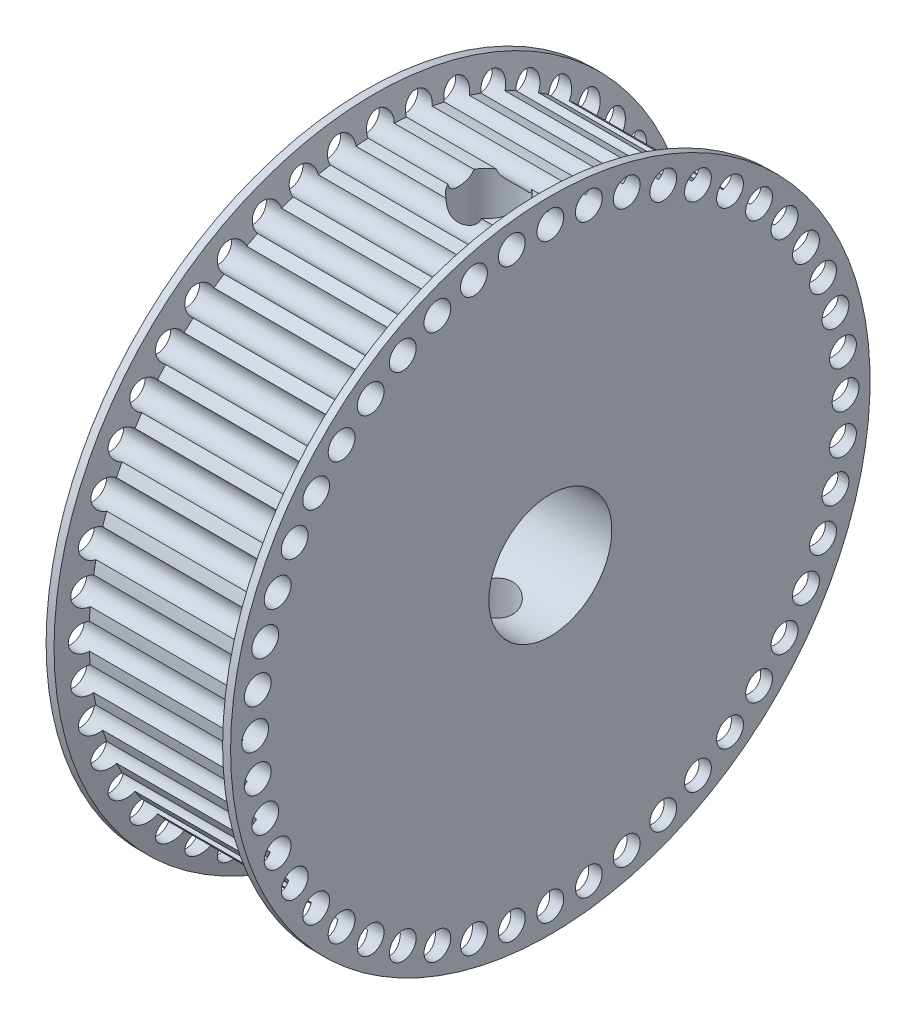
from build123d import *

# Parameters (mm, degrees)
SKETCH3_R          = 2.7686
CUT_EXTRUDE2_DEPTH = 101.86710663
CIRPATTERN1_COUNT  = 48
SKETCH5_R          = 3.175
CUT_EXTRUDE3_DEPTH = 147.645135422
SKETCH6_R          = 4.8895
CUT_EXTRUDE4_DEPTH = 120.65
SKETCH7_R          = 6.35
CUT_EXTRUDE5_DEPTH = 19.05


with BuildPart() as part:
    # Sketch1 → Revolve2 (revolve)
    with BuildSketch(Plane.XY, mode=Mode.PRIVATE) as revolve2_sk:
        Polygon((-19.05, 12.7), (19.05, 12.7), (19.05, 66.04), (17.406329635, 66.04), (15.875, 60.325), (-15.875, 60.325), (-17.406329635, 66.04), (-19.05, 66.04), align=None)
    revolve(revolve2_sk.sketch.rotate(Axis((-51.416444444, 0, 0), (1, 0, 0)), 90), axis=Axis((-51.416444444, 0, 0), (1, 0, 0)))

    # Sketch3 → Cut-Extrude2 (cut, through all)
    with BuildSketch(Plane(origin=(19.05, 0, 0), x_dir=(0, 0, -1), z_dir=(1, 0, 0))):
        with Locations((0, 60.96)):
            Circle(SKETCH3_R)
    cut_extrude2 = extrude(amount=-CUT_EXTRUDE2_DEPTH, mode=Mode.SUBTRACT)

    # CirPattern1: Cut-Extrude2 ×48 about axis
    cirpattern1_axis = Axis((0, 0, 0), (1, 0, 0))
    for i in range(1, CIRPATTERN1_COUNT):
        add(cut_extrude2.rotate(cirpattern1_axis, i * 360 / CIRPATTERN1_COUNT), mode=Mode.SUBTRACT)

    # Sketch5 → Cut-Extrude3 (cut, through all)
    with BuildSketch(Plane(origin=(0, 63.5, 0), x_dir=(-1, 0, 0), z_dir=(0, 1, 0))):
        with Locations(Location((-6.35, 0, 0), (0, 0, 90))):
            Circle(SKETCH5_R)
    extrude(amount=-CUT_EXTRUDE3_DEPTH, mode=Mode.SUBTRACT)

    # Sketch6 → Cut-Extrude4 (cut)
    with BuildSketch(Plane(origin=(0, 63.5, 0), x_dir=(-1, 0, 0), z_dir=(0, 1, 0))):
        with Locations(Location((-6.35, 0, 0), (0, 0, 90))):
            Circle(SKETCH6_R)
    extrude(amount=-CUT_EXTRUDE4_DEPTH, mode=Mode.SUBTRACT)

    # Sketch7 → Cut-Extrude5 (cut)
    with BuildSketch(Plane(origin=(0, 63.5, 0), x_dir=(-1, 0, 0), z_dir=(0, 1, 0))):
        with Locations(Location((-6.35, 0, 0), (0, 0, 90))):
            Circle(SKETCH7_R)
    extrude(amount=-CUT_EXTRUDE5_DEPTH, mode=Mode.SUBTRACT)


solid = part.part
